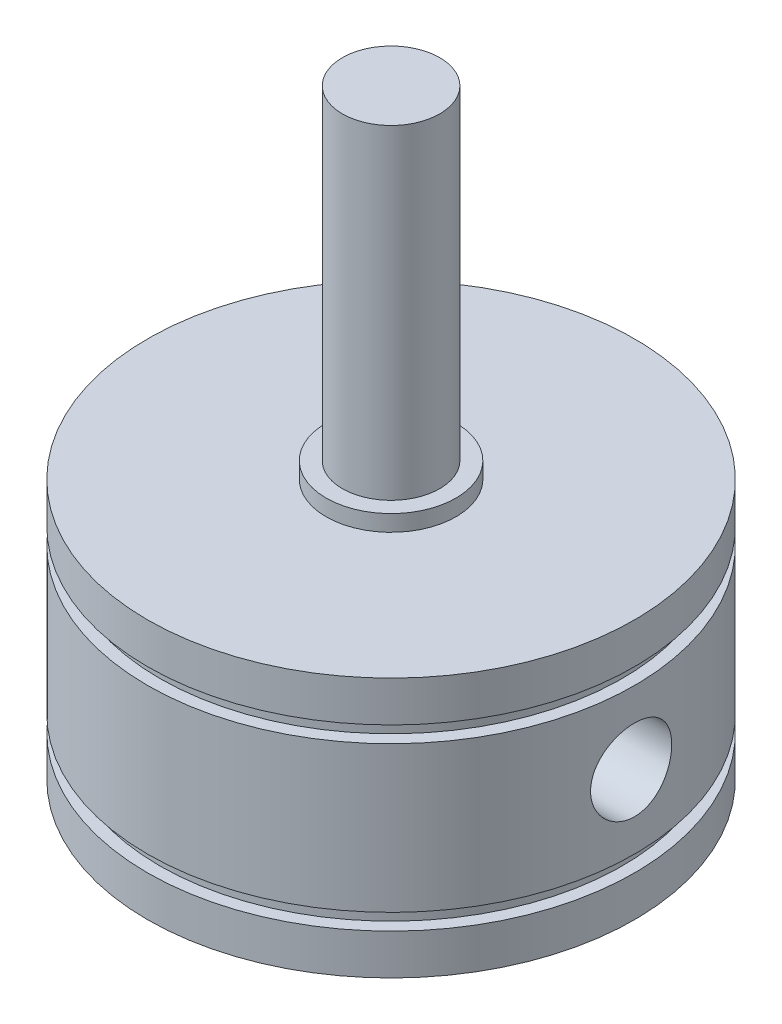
ISO-10303-21;
HEADER;
FILE_DESCRIPTION(('STEP AP214'),'2;1');
FILE_NAME('part.step','',(''),(''),'','','');
FILE_SCHEMA(('AUTOMOTIVE_DESIGN { 1 0 10303 214 1 1 1 1 }'));
ENDSEC;
DATA;
#1=APPLICATION_CONTEXT('core data for automotive mechanical design processes');
#2=APPLICATION_PROTOCOL_DEFINITION('international standard','automotive_design',2000,#1);
#3=PRODUCT_CONTEXT('',#1,'mechanical');
#4=PRODUCT('Part','Part','',(#3));
#5=PRODUCT_RELATED_PRODUCT_CATEGORY('part','',(#4));
#6=PRODUCT_DEFINITION_FORMATION('','',#4);
#7=PRODUCT_DEFINITION_CONTEXT('part definition',#1,'design');
#8=PRODUCT_DEFINITION('design','',#6,#7);
#9=PRODUCT_DEFINITION_SHAPE('','',#8);
#10=(LENGTH_UNIT() NAMED_UNIT(*) SI_UNIT(.MILLI.,.METRE.));
#11=(NAMED_UNIT(*) PLANE_ANGLE_UNIT() SI_UNIT($,.RADIAN.));
#12=(NAMED_UNIT(*) SI_UNIT($,.STERADIAN.) SOLID_ANGLE_UNIT());
#13=UNCERTAINTY_MEASURE_WITH_UNIT(LENGTH_MEASURE(1.E-05),#10,'distance_accuracy_value','');
#14=(GEOMETRIC_REPRESENTATION_CONTEXT(3) GLOBAL_UNCERTAINTY_ASSIGNED_CONTEXT((#13)) GLOBAL_UNIT_ASSIGNED_CONTEXT((#10,
#11,#12)) REPRESENTATION_CONTEXT('',''));
#15=CARTESIAN_POINT('',(0.,0.,0.));
#16=DIRECTION('',(0.,0.,1.));
#17=DIRECTION('',(1.,0.,0.));
#18=AXIS2_PLACEMENT_3D('',#15,#16,#17);
#19=CARTESIAN_POINT('',(3.,0.,0.));
#20=DIRECTION('',(0.,1.,0.));
#21=DIRECTION('',(0.,0.,1.));
#22=AXIS2_PLACEMENT_3D('',#19,#20,#21);
#23=PLANE('',#22);
#24=CARTESIAN_POINT('',(0.,0.,0.));
#25=DIRECTION('',(0.,1.,0.));
#26=DIRECTION('',(0.,0.,1.));
#27=AXIS2_PLACEMENT_3D('',#24,#25,#26);
#28=CIRCLE('',#27,3.);
#29=CARTESIAN_POINT('',(0.,0.,3.));
#30=VERTEX_POINT('',#29);
#31=EDGE_CURVE('E194',#30,#30,#28,.T.);
#32=ORIENTED_EDGE('',*,*,#31,.F.);
#33=EDGE_LOOP('',(#32));
#34=FACE_BOUND('',#33,.T.);
#35=ADVANCED_FACE('F109',(#34),#23,.F.);
#36=CARTESIAN_POINT('',(0.,41.,0.));
#37=DIRECTION('',(0.,-1.,0.));
#38=DIRECTION('',(0.,0.,-1.));
#39=AXIS2_PLACEMENT_3D('',#36,#37,#38);
#40=PLANE('',#39);
#41=CARTESIAN_POINT('',(0.,41.,0.));
#42=DIRECTION('',(0.,1.,0.));
#43=DIRECTION('',(0.,0.,1.));
#44=AXIS2_PLACEMENT_3D('',#41,#42,#43);
#45=CIRCLE('',#44,3.);
#46=CARTESIAN_POINT('',(0.,41.,3.));
#47=VERTEX_POINT('',#46);
#48=EDGE_CURVE('E119',#47,#47,#45,.T.);
#49=ORIENTED_EDGE('',*,*,#48,.T.);
#50=EDGE_LOOP('',(#49));
#51=FACE_BOUND('',#50,.T.);
#52=ADVANCED_FACE('F185',(#51),#40,.F.);
#53=CARTESIAN_POINT('',(0.,52.8834340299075,0.));
#54=DIRECTION('',(0.,1.,0.));
#55=DIRECTION('',(0.,0.,1.));
#56=AXIS2_PLACEMENT_3D('',#53,#54,#55);
#57=CYLINDRICAL_SURFACE('',#56,3.);
#58=ORIENTED_EDGE('',*,*,#48,.F.);
#59=EDGE_LOOP('',(#58));
#60=FACE_BOUND('',#59,.T.);
#61=CARTESIAN_POINT('',(0.,21.,0.));
#62=DIRECTION('',(0.,1.,0.));
#63=DIRECTION('',(0.,0.,1.));
#64=AXIS2_PLACEMENT_3D('',#61,#62,#63);
#65=CIRCLE('',#64,3.);
#66=CARTESIAN_POINT('',(0.,21.,3.));
#67=VERTEX_POINT('',#66);
#68=EDGE_CURVE('E124',#67,#67,#65,.T.);
#69=ORIENTED_EDGE('',*,*,#68,.T.);
#70=EDGE_LOOP('',(#69));
#71=FACE_BOUND('',#70,.T.);
#72=ADVANCED_FACE('F190',(#60,#71),#57,.T.);
#73=CARTESIAN_POINT('',(3.,21.,0.));
#74=DIRECTION('',(0.,-1.,0.));
#75=DIRECTION('',(0.,0.,-1.));
#76=AXIS2_PLACEMENT_3D('',#73,#74,#75);
#77=PLANE('',#76);
#78=ORIENTED_EDGE('',*,*,#68,.F.);
#79=EDGE_LOOP('',(#78));
#80=FACE_BOUND('',#79,.T.);
#81=CARTESIAN_POINT('',(0.,21.,0.));
#82=DIRECTION('',(0.,1.,0.));
#83=DIRECTION('',(0.,0.,1.));
#84=AXIS2_PLACEMENT_3D('',#81,#82,#83);
#85=CIRCLE('',#84,4.);
#86=CARTESIAN_POINT('',(0.,21.,4.));
#87=VERTEX_POINT('',#86);
#88=EDGE_CURVE('E246',#87,#87,#85,.T.);
#89=ORIENTED_EDGE('',*,*,#88,.T.);
#90=EDGE_LOOP('',(#89));
#91=FACE_BOUND('',#90,.T.);
#92=ADVANCED_FACE('F252',(#80,#91),#77,.F.);
#93=CARTESIAN_POINT('',(0.,52.8834340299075,0.));
#94=DIRECTION('',(0.,1.,0.));
#95=DIRECTION('',(0.,0.,1.));
#96=AXIS2_PLACEMENT_3D('',#93,#94,#95);
#97=CYLINDRICAL_SURFACE('',#96,4.);
#98=ORIENTED_EDGE('',*,*,#88,.F.);
#99=EDGE_LOOP('',(#98));
#100=FACE_BOUND('',#99,.T.);
#101=CARTESIAN_POINT('',(0.,20.,0.));
#102=DIRECTION('',(0.,1.,0.));
#103=DIRECTION('',(0.,0.,1.));
#104=AXIS2_PLACEMENT_3D('',#101,#102,#103);
#105=CIRCLE('',#104,4.);
#106=CARTESIAN_POINT('',(0.,20.,4.));
#107=VERTEX_POINT('',#106);
#108=EDGE_CURVE('E243',#107,#107,#105,.T.);
#109=ORIENTED_EDGE('',*,*,#108,.T.);
#110=EDGE_LOOP('',(#109));
#111=FACE_BOUND('',#110,.T.);
#112=ADVANCED_FACE('F255',(#100,#111),#97,.T.);
#113=CARTESIAN_POINT('',(4.,20.,0.));
#114=DIRECTION('',(0.,-1.,0.));
#115=DIRECTION('',(0.,0.,-1.));
#116=AXIS2_PLACEMENT_3D('',#113,#114,#115);
#117=PLANE('',#116);
#118=ORIENTED_EDGE('',*,*,#108,.F.);
#119=EDGE_LOOP('',(#118));
#120=FACE_BOUND('',#119,.T.);
#121=CARTESIAN_POINT('',(0.,20.,0.));
#122=DIRECTION('',(0.,1.,0.));
#123=DIRECTION('',(0.,0.,1.));
#124=AXIS2_PLACEMENT_3D('',#121,#122,#123);
#125=CIRCLE('',#124,15.);
#126=CARTESIAN_POINT('',(0.,20.,15.));
#127=VERTEX_POINT('',#126);
#128=EDGE_CURVE('E240',#127,#127,#125,.T.);
#129=ORIENTED_EDGE('',*,*,#128,.T.);
#130=EDGE_LOOP('',(#129));
#131=FACE_BOUND('',#130,.T.);
#132=ADVANCED_FACE('F261',(#120,#131),#117,.F.);
#133=CARTESIAN_POINT('',(0.,52.8834340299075,0.));
#134=DIRECTION('',(0.,1.,0.));
#135=DIRECTION('',(0.,0.,1.));
#136=AXIS2_PLACEMENT_3D('',#133,#134,#135);
#137=CYLINDRICAL_SURFACE('',#136,15.);
#138=ORIENTED_EDGE('',*,*,#128,.F.);
#139=EDGE_LOOP('',(#138));
#140=FACE_BOUND('',#139,.T.);
#141=CARTESIAN_POINT('',(0.,17.5,0.));
#142=DIRECTION('',(0.,1.,0.));
#143=DIRECTION('',(0.,0.,1.));
#144=AXIS2_PLACEMENT_3D('',#141,#142,#143);
#145=CIRCLE('',#144,15.);
#146=CARTESIAN_POINT('',(0.,17.5,15.));
#147=VERTEX_POINT('',#146);
#148=EDGE_CURVE('E237',#147,#147,#145,.T.);
#149=ORIENTED_EDGE('',*,*,#148,.T.);
#150=EDGE_LOOP('',(#149));
#151=FACE_BOUND('',#150,.T.);
#152=ADVANCED_FACE('F267',(#140,#151),#137,.T.);
#153=CARTESIAN_POINT('',(15.,17.5,0.));
#154=DIRECTION('',(0.,1.,0.));
#155=DIRECTION('',(0.,0.,1.));
#156=AXIS2_PLACEMENT_3D('',#153,#154,#155);
#157=PLANE('',#156);
#158=ORIENTED_EDGE('',*,*,#148,.F.);
#159=EDGE_LOOP('',(#158));
#160=FACE_BOUND('',#159,.T.);
#161=CARTESIAN_POINT('',(0.,17.5,0.));
#162=DIRECTION('',(0.,1.,0.));
#163=DIRECTION('',(0.,0.,1.));
#164=AXIS2_PLACEMENT_3D('',#161,#162,#163);
#165=CIRCLE('',#164,14.25);
#166=CARTESIAN_POINT('',(0.,17.5,14.25));
#167=VERTEX_POINT('',#166);
#168=EDGE_CURVE('E234',#167,#167,#165,.T.);
#169=ORIENTED_EDGE('',*,*,#168,.T.);
#170=EDGE_LOOP('',(#169));
#171=FACE_BOUND('',#170,.T.);
#172=ADVANCED_FACE('F273',(#160,#171),#157,.F.);
#173=CARTESIAN_POINT('',(0.,52.8834340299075,0.));
#174=DIRECTION('',(0.,1.,0.));
#175=DIRECTION('',(0.,0.,1.));
#176=AXIS2_PLACEMENT_3D('',#173,#174,#175);
#177=CYLINDRICAL_SURFACE('',#176,14.25);
#178=ORIENTED_EDGE('',*,*,#168,.F.);
#179=EDGE_LOOP('',(#178));
#180=FACE_BOUND('',#179,.T.);
#181=CARTESIAN_POINT('',(0.,16.5,0.));
#182=DIRECTION('',(0.,1.,0.));
#183=DIRECTION('',(0.,0.,1.));
#184=AXIS2_PLACEMENT_3D('',#181,#182,#183);
#185=CIRCLE('',#184,14.25);
#186=CARTESIAN_POINT('',(0.,16.5,14.25));
#187=VERTEX_POINT('',#186);
#188=EDGE_CURVE('E231',#187,#187,#185,.T.);
#189=ORIENTED_EDGE('',*,*,#188,.T.);
#190=EDGE_LOOP('',(#189));
#191=FACE_BOUND('',#190,.T.);
#192=ADVANCED_FACE('F279',(#180,#191),#177,.T.);
#193=CARTESIAN_POINT('',(14.25,16.5,0.));
#194=DIRECTION('',(0.,-1.,0.));
#195=DIRECTION('',(0.,0.,-1.));
#196=AXIS2_PLACEMENT_3D('',#193,#194,#195);
#197=PLANE('',#196);
#198=ORIENTED_EDGE('',*,*,#188,.F.);
#199=EDGE_LOOP('',(#198));
#200=FACE_BOUND('',#199,.T.);
#201=CARTESIAN_POINT('',(0.,16.5,0.));
#202=DIRECTION('',(0.,1.,0.));
#203=DIRECTION('',(0.,0.,1.));
#204=AXIS2_PLACEMENT_3D('',#201,#202,#203);
#205=CIRCLE('',#204,15.);
#206=CARTESIAN_POINT('',(0.,16.5,15.));
#207=VERTEX_POINT('',#206);
#208=EDGE_CURVE('E228',#207,#207,#205,.T.);
#209=ORIENTED_EDGE('',*,*,#208,.T.);
#210=EDGE_LOOP('',(#209));
#211=FACE_BOUND('',#210,.T.);
#212=ADVANCED_FACE('F180',(#200,#211),#197,.F.);
#213=CARTESIAN_POINT('',(0.,52.8834340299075,0.));
#214=DIRECTION('',(0.,1.,0.));
#215=DIRECTION('',(0.,0.,1.));
#216=AXIS2_PLACEMENT_3D('',#213,#214,#215);
#217=CYLINDRICAL_SURFACE('',#216,15.);
#218=CARTESIAN_POINT('',(-14.644440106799,8.78065504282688,3.24659420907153));
#219=CARTESIAN_POINT('',(-14.6934693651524,8.78065399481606,3.02543653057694));
#220=CARTESIAN_POINT('',(-14.7374902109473,8.78089183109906,2.80315828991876));
#221=CARTESIAN_POINT('',(-14.8154311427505,8.78195007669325,2.35676801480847));
#222=CARTESIAN_POINT('',(-14.8493478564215,8.78277068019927,2.13265539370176));
#223=CARTESIAN_POINT('',(-14.9070048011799,8.7853042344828,1.68303281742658));
#224=CARTESIAN_POINT('',(-14.9307407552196,8.78701755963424,1.45752231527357));
#225=CARTESIAN_POINT('',(-14.9681436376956,8.7918090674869,1.00351744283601));
#226=CARTESIAN_POINT('',(-14.9817125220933,8.79490009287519,0.775015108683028));
#227=CARTESIAN_POINT('',(-14.9983780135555,8.80299690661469,0.317766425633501));
#228=CARTESIAN_POINT('',(-15.0014792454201,8.80800184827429,0.0890202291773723));
#229=CARTESIAN_POINT('',(-14.9972235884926,8.82047977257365,-0.367997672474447));
#230=CARTESIAN_POINT('',(-14.9898816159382,8.82794922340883,-0.596269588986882));
#231=CARTESIAN_POINT('',(-14.974202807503,8.83915495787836,-0.881200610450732));
#232=CARTESIAN_POINT('',(-14.9707390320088,8.84149138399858,-0.938208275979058));
#233=CARTESIAN_POINT('',(-14.9631611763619,8.84635862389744,-1.05217317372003));
#234=CARTESIAN_POINT('',(-14.959047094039,8.84888943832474,-1.10913040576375));
#235=CARTESIAN_POINT('',(-14.9501643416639,8.854155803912,-1.22305125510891));
#236=CARTESIAN_POINT('',(-14.945394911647,8.85689159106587,-1.28001480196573));
#237=CARTESIAN_POINT('',(-14.9352064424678,8.86257205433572,-1.39387052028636));
#238=CARTESIAN_POINT('',(-14.9297874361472,8.86551671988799,-1.4507626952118));
#239=CARTESIAN_POINT('',(-14.9182805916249,8.87163248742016,-1.56467011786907));
#240=CARTESIAN_POINT('',(-14.9121904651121,8.87480435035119,-1.62168509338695));
#241=CARTESIAN_POINT('',(-14.89935722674,8.88137190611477,-1.73563887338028));
#242=CARTESIAN_POINT('',(-14.8926140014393,8.88476763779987,-1.79257766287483));
#243=CARTESIAN_POINT('',(-14.8820662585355,8.8900066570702,-1.87747175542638));
#244=CARTESIAN_POINT('',(-14.8785081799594,8.89176269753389,-1.90546331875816));
#245=CARTESIAN_POINT('',(-14.8712345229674,8.89532996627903,-1.96142291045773));
#246=CARTESIAN_POINT('',(-14.8675189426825,8.89714119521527,-1.98939093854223));
#247=CARTESIAN_POINT('',(-14.8618281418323,8.89990371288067,-2.03132055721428));
#248=CARTESIAN_POINT('',(-14.8599118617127,8.90083205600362,-2.04529176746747));
#249=CARTESIAN_POINT('',(-14.856039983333,8.90269720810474,-2.0732281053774));
#250=CARTESIAN_POINT('',(-14.8540843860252,8.90363401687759,-2.08719323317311));
#251=CARTESIAN_POINT('',(-14.8481629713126,8.90680660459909,-2.12904922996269));
#252=CARTESIAN_POINT('',(-14.844141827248,8.90940475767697,-2.15690589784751));
#253=CARTESIAN_POINT('',(-14.8359798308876,8.91544907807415,-2.21234785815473));
#254=CARTESIAN_POINT('',(-14.8318397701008,8.91889044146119,-2.23993379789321));
#255=CARTESIAN_POINT('',(-14.8234241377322,8.92664555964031,-2.29496670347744));
#256=CARTESIAN_POINT('',(-14.8191485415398,8.93095947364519,-2.32241364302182));
#257=CARTESIAN_POINT('',(-14.8061267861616,8.94519080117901,-2.40451218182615));
#258=CARTESIAN_POINT('',(-14.7971865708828,8.95639712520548,-2.45891532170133));
#259=CARTESIAN_POINT('',(-14.778881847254,8.98213682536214,-2.56663708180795));
#260=CARTESIAN_POINT('',(-14.7695190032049,8.9966579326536,-2.61995893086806));
#261=CARTESIAN_POINT('',(-14.7504042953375,9.02897259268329,-2.72551845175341));
#262=CARTESIAN_POINT('',(-14.7406524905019,9.04676565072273,-2.77775628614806));
#263=CARTESIAN_POINT('',(-14.716432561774,9.09415258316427,-2.90385258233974));
#264=CARTESIAN_POINT('',(-14.7017896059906,9.12548162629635,-2.97703286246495));
#265=CARTESIAN_POINT('',(-14.6720263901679,9.19457453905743,-3.12042020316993));
#266=CARTESIAN_POINT('',(-14.6569049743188,9.23235514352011,-3.19061892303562));
#267=CARTESIAN_POINT('',(-14.6263764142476,9.31405495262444,-3.32777284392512));
#268=CARTESIAN_POINT('',(-14.6109682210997,9.35800383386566,-3.39471012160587));
#269=CARTESIAN_POINT('',(-14.5802107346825,9.45147652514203,-3.52447127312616));
#270=CARTESIAN_POINT('',(-14.5648613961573,9.50099434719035,-3.58729945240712));
#271=CARTESIAN_POINT('',(-14.5345237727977,9.60510014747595,-3.70830078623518));
#272=CARTESIAN_POINT('',(-14.5195344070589,9.659669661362,-3.76648955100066));
#273=CARTESIAN_POINT('',(-14.4901335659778,9.77369755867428,-3.87806171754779));
#274=CARTESIAN_POINT('',(-14.4757222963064,9.83315765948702,-3.93144341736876));
#275=CARTESIAN_POINT('',(-14.4477316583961,9.95632719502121,-4.03309117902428));
#276=CARTESIAN_POINT('',(-14.4341511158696,10.0200303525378,-4.08136453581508));
#277=CARTESIAN_POINT('',(-14.4080206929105,10.1512808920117,-4.17267237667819));
#278=CARTESIAN_POINT('',(-14.3954707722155,10.218828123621,-4.21570706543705));
#279=CARTESIAN_POINT('',(-14.3714042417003,10.3586572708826,-4.29704234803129));
#280=CARTESIAN_POINT('',(-14.3599117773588,10.4310047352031,-4.33523753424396));
#281=CARTESIAN_POINT('',(-14.3384902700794,10.5788055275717,-4.40557020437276));
#282=CARTESIAN_POINT('',(-14.3285610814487,10.6542585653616,-4.43770825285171));
#283=CARTESIAN_POINT('',(-14.3104900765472,10.8077766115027,-4.49564211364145));
#284=CARTESIAN_POINT('',(-14.3023484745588,10.8858419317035,-4.5214371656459));
#285=CARTESIAN_POINT('',(-14.2879538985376,11.043961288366,-4.56672052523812));
#286=CARTESIAN_POINT('',(-14.2817012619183,11.1240156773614,-4.58620770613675));
#287=CARTESIAN_POINT('',(-14.2711877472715,11.2857454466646,-4.61881968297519));
#288=CARTESIAN_POINT('',(-14.2669318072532,11.3674243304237,-4.63192870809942));
#289=CARTESIAN_POINT('',(-14.260538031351,11.5316401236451,-4.65157626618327));
#290=CARTESIAN_POINT('',(-14.2583997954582,11.6141768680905,-4.65811603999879));
#291=CARTESIAN_POINT('',(-14.2563598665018,11.7795555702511,-4.66435581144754));
#292=CARTESIAN_POINT('',(-14.2564585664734,11.8623975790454,-4.66405460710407));
#293=CARTESIAN_POINT('',(-14.2588884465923,12.0277474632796,-4.6566205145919));
#294=CARTESIAN_POINT('',(-14.2612199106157,12.1102552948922,-4.64948675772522));
#295=CARTESIAN_POINT('',(-14.267961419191,12.273318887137,-4.62875729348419));
#296=CARTESIAN_POINT('',(-14.2723452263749,12.353886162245,-4.61524313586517));
#297=CARTESIAN_POINT('',(-14.2830864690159,12.5135640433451,-4.58189341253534));
#298=CARTESIAN_POINT('',(-14.2894438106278,12.5926747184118,-4.56205814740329));
#299=CARTESIAN_POINT('',(-14.3040219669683,12.7488437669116,-4.51614182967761));
#300=CARTESIAN_POINT('',(-14.3122417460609,12.8259032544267,-4.49006424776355));
#301=CARTESIAN_POINT('',(-14.3304479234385,12.977378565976,-4.43161320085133));
#302=CARTESIAN_POINT('',(-14.340434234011,13.0517945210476,-4.39924004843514));
#303=CARTESIAN_POINT('',(-14.3619534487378,13.1975467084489,-4.32847106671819));
#304=CARTESIAN_POINT('',(-14.3734876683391,13.2688802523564,-4.29007011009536));
#305=CARTESIAN_POINT('',(-14.3978480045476,13.407962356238,-4.207590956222));
#306=CARTESIAN_POINT('',(-14.410674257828,13.4757105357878,-4.16351215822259));
#307=CARTESIAN_POINT('',(-14.4374033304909,13.6072968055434,-4.06986014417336));
#308=CARTESIAN_POINT('',(-14.4513083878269,13.671126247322,-4.02027540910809));
#309=CARTESIAN_POINT('',(-14.4799367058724,13.7941882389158,-3.91591116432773));
#310=CARTESIAN_POINT('',(-14.4946599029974,13.8534211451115,-3.86113205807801));
#311=CARTESIAN_POINT('',(-14.5246748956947,13.9667440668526,-3.74664079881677));
#312=CARTESIAN_POINT('',(-14.5399666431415,14.0208345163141,-3.6869290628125));
#313=CARTESIAN_POINT('',(-14.5708236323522,14.1235222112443,-3.56302883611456));
#314=CARTESIAN_POINT('',(-14.5863888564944,14.1721198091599,-3.49884063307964));
#315=CARTESIAN_POINT('',(-14.6174360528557,14.2632230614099,-3.36677010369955));
#316=CARTESIAN_POINT('',(-14.6329180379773,14.3057590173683,-3.29890867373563));
#317=CARTESIAN_POINT('',(-14.6636298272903,14.3846869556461,-3.15959604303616));
#318=CARTESIAN_POINT('',(-14.6788595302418,14.4210765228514,-3.08814344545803));
#319=CARTESIAN_POINT('',(-14.7035223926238,14.4755499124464,-2.9679544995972));
#320=CARTESIAN_POINT('',(-14.7131024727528,14.4955589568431,-2.92011135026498));
#321=CARTESIAN_POINT('',(-14.7319873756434,14.5327322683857,-2.82329215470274));
#322=CARTESIAN_POINT('',(-14.741292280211,14.5498973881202,-2.77431645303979));
#323=CARTESIAN_POINT('',(-14.7595576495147,14.5813065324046,-2.67544073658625));
#324=CARTESIAN_POINT('',(-14.7685185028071,14.5955539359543,-2.6255418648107));
#325=CARTESIAN_POINT('',(-14.7861018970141,14.6211702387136,-2.5246438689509));
#326=CARTESIAN_POINT('',(-14.7947222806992,14.6325226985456,-2.47364017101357));
#327=CARTESIAN_POINT('',(-14.8073220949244,14.6472783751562,-2.39664140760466));
#328=CARTESIAN_POINT('',(-14.8114679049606,14.6518189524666,-2.37088642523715));
#329=CARTESIAN_POINT('',(-14.8196432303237,14.6601354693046,-2.31923648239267));
#330=CARTESIAN_POINT('',(-14.8236727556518,14.6639114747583,-2.29334153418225));
#331=CARTESIAN_POINT('',(-14.8316156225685,14.670698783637,-2.24139894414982));
#332=CARTESIAN_POINT('',(-14.8355288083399,14.6737090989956,-2.2153511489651));
#333=CARTESIAN_POINT('',(-14.8413038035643,14.6776393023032,-2.17620665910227));
#334=CARTESIAN_POINT('',(-14.8432131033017,14.6788518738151,-2.16314566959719));
#335=CARTESIAN_POINT('',(-14.8469995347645,14.6810858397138,-2.13700240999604));
#336=CARTESIAN_POINT('',(-14.8488766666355,14.682107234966,-2.12392013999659));
#337=CARTESIAN_POINT('',(-14.8542218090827,14.684738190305,-2.08631426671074));
#338=CARTESIAN_POINT('',(-14.8576488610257,14.6860833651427,-2.06176720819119));
#339=CARTESIAN_POINT('',(-14.8643808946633,14.6888114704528,-2.01265878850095));
#340=CARTESIAN_POINT('',(-14.8676858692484,14.6901944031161,-1.98809742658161));
#341=CARTESIAN_POINT('',(-14.8741747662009,14.6928988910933,-1.93895311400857));
#342=CARTESIAN_POINT('',(-14.877358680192,14.6942204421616,-1.91437016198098));
#343=CARTESIAN_POINT('',(-14.8836047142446,14.6968290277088,-1.86518772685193));
#344=CARTESIAN_POINT('',(-14.8866668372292,14.698116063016,-1.84058824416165));
#345=CARTESIAN_POINT('',(-14.8956707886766,14.7019164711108,-1.76676259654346));
#346=CARTESIAN_POINT('',(-14.9014299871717,14.7043690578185,-1.7175108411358));
#347=CARTESIAN_POINT('',(-14.9124601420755,14.709121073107,-1.61894766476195));
#348=CARTESIAN_POINT('',(-14.9177311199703,14.7114205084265,-1.56963624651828));
#349=CARTESIAN_POINT('',(-14.9277844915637,14.7158691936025,-1.47095545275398));
#350=CARTESIAN_POINT('',(-14.93256687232,14.7180184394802,-1.42158607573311));
#351=CARTESIAN_POINT('',(-14.9416422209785,14.722171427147,-1.32279564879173));
#352=CARTESIAN_POINT('',(-14.9459351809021,14.724175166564,-1.2733745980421));
#353=CARTESIAN_POINT('',(-14.9580763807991,14.729973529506,-1.12507285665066));
#354=CARTESIAN_POINT('',(-14.9651900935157,14.7335566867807,-1.02612263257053));
#355=CARTESIAN_POINT('',(-14.9774529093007,14.7401967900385,-0.828096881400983));
#356=CARTESIAN_POINT('',(-14.9826022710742,14.7432538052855,-0.729021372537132));
#357=CARTESIAN_POINT('',(-14.9909345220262,14.7488831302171,-0.530777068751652));
#358=CARTESIAN_POINT('',(-14.9941174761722,14.7514554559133,-0.43160827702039));
#359=CARTESIAN_POINT('',(-14.9985148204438,14.7561583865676,-0.233228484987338));
#360=CARTESIAN_POINT('',(-14.9997294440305,14.7582890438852,-0.134017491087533));
#361=CARTESIAN_POINT('',(-15.0001898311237,14.7621539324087,0.0644223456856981));
#362=CARTESIAN_POINT('',(-14.9994354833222,14.763888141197,0.163651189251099));
#363=CARTESIAN_POINT('',(-14.9959576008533,14.7670058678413,0.362080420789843));
#364=CARTESIAN_POINT('',(-14.9932340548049,14.7683893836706,0.461280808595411));
#365=CARTESIAN_POINT('',(-14.9858193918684,14.7708515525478,0.659591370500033));
#366=CARTESIAN_POINT('',(-14.9811286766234,14.7719302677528,0.758701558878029));
#367=CARTESIAN_POINT('',(-14.969781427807,14.7738291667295,0.956811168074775));
#368=CARTESIAN_POINT('',(-14.9631249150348,14.7746493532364,1.05581059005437));
#369=CARTESIAN_POINT('',(-14.9478486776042,14.7760751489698,1.25366093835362));
#370=CARTESIAN_POINT('',(-14.9392288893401,14.7766807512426,1.35251185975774));
#371=CARTESIAN_POINT('',(-14.9095466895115,14.7782866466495,1.6578581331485));
#372=CARTESIAN_POINT('',(-14.8851746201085,14.7789959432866,1.86404370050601));
#373=CARTESIAN_POINT('',(-14.8278932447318,14.7799845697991,2.27523136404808));
#374=CARTESIAN_POINT('',(-14.7949834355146,14.7802638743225,2.4802333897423));
#375=CARTESIAN_POINT('',(-14.7206587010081,14.7806048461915,2.88883257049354));
#376=CARTESIAN_POINT('',(-14.6792381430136,14.7806663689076,3.09242870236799));
#377=CARTESIAN_POINT('',(-14.5879768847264,14.7806406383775,3.49772490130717));
#378=CARTESIAN_POINT('',(-14.538136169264,14.7805533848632,3.69942496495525));
#379=CARTESIAN_POINT('',(-14.4303489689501,14.7801452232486,4.09973329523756));
#380=CARTESIAN_POINT('',(-14.3724376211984,14.779825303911,4.29835102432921));
#381=CARTESIAN_POINT('',(-14.2484502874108,14.7787202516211,4.69302124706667));
#382=CARTESIAN_POINT('',(-14.1823742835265,14.7779351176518,4.88907373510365));
#383=CARTESIAN_POINT('',(-14.0422884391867,14.7755506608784,5.27795209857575));
#384=CARTESIAN_POINT('',(-13.9682918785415,14.7739526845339,5.47078276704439));
#385=CARTESIAN_POINT('',(-13.8124036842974,14.7695128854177,5.85321626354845));
#386=CARTESIAN_POINT('',(-13.7305120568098,14.7666710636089,6.04281909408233));
#387=CARTESIAN_POINT('',(-13.5807645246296,14.7602158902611,6.3707588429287));
#388=CARTESIAN_POINT('',(-13.5146240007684,14.7569816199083,6.50988956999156));
#389=CARTESIAN_POINT('',(-13.3781127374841,14.7493696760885,6.78600117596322));
#390=CARTESIAN_POINT('',(-13.3077427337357,14.7449922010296,6.92298242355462));
#391=CARTESIAN_POINT('',(-13.1625047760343,14.7348873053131,7.1953034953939));
#392=CARTESIAN_POINT('',(-13.0876175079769,14.7291537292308,7.33063278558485));
#393=CARTESIAN_POINT('',(-12.9336955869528,14.7161745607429,7.5989105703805));
#394=CARTESIAN_POINT('',(-12.8546593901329,14.7089284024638,7.73185815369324));
#395=CARTESIAN_POINT('',(-12.740534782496,14.6975552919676,7.91724420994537));
#396=CARTESIAN_POINT('',(-12.707120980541,14.6941204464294,7.97076257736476));
#397=CARTESIAN_POINT('',(-12.6565076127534,14.6887549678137,8.0507024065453));
#398=CARTESIAN_POINT('',(-12.639557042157,14.6869312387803,8.07728863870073));
#399=CARTESIAN_POINT('',(-12.6140065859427,14.6841405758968,8.11708607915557));
#400=CARTESIAN_POINT('',(-12.6054685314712,14.6832011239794,8.13033896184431));
#401=CARTESIAN_POINT('',(-12.5883510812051,14.6813051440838,8.15681712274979));
#402=CARTESIAN_POINT('',(-12.5797716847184,14.6803486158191,8.17004240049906));
#403=CARTESIAN_POINT('',(-12.5625755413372,14.6784130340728,8.19645924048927));
#404=CARTESIAN_POINT('',(-12.5539588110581,14.6774339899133,8.20965081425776));
#405=CARTESIAN_POINT('',(-12.5410026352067,14.6759642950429,8.22941765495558));
#406=CARTESIAN_POINT('',(-12.5366787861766,14.6754742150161,8.23600309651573));
#407=CARTESIAN_POINT('',(-12.528023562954,14.6744178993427,8.24916284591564));
#408=CARTESIAN_POINT('',(-12.5236921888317,14.6738516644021,8.25573715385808));
#409=CARTESIAN_POINT('',(-12.5020208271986,14.6708448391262,8.28857440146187));
#410=CARTESIAN_POINT('',(-12.484624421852,14.6678757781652,8.31475416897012));
#411=CARTESIAN_POINT('',(-12.4498826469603,14.6608385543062,8.36668333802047));
#412=CARTESIAN_POINT('',(-12.4325380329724,14.6567796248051,8.39243450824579));
#413=CARTESIAN_POINT('',(-12.397777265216,14.6475636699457,8.44370050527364));
#414=CARTESIAN_POINT('',(-12.3803610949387,14.6424063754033,8.46921527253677));
#415=CARTESIAN_POINT('',(-12.3454846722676,14.6310028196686,8.51997396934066));
#416=CARTESIAN_POINT('',(-12.3280244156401,14.6247564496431,8.54521787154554));
#417=CARTESIAN_POINT('',(-12.2930897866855,14.6111869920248,8.59539867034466));
#418=CARTESIAN_POINT('',(-12.275615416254,14.6038640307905,8.62033560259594));
#419=CARTESIAN_POINT('',(-12.2232131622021,14.5802984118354,8.69463810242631));
#420=CARTESIAN_POINT('',(-12.1882952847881,14.5624554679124,8.74351115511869));
#421=CARTESIAN_POINT('',(-12.1109062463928,14.5181369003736,8.85049293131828));
#422=CARTESIAN_POINT('',(-12.0684951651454,14.4906228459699,8.90821822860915));
#423=CARTESIAN_POINT('',(-11.9844528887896,14.4295941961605,9.02096719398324));
#424=CARTESIAN_POINT('',(-11.9428217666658,14.3960790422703,9.0759906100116));
#425=CARTESIAN_POINT('',(-11.8190847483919,14.2866030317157,9.23729364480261));
#426=CARTESIAN_POINT('',(-11.7386049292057,14.201982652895,9.33916089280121));
#427=CARTESIAN_POINT('',(-11.6237581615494,14.0603438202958,9.4811379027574));
#428=CARTESIAN_POINT('',(-11.5865030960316,14.0107596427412,9.52660313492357));
#429=CARTESIAN_POINT('',(-11.5142115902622,13.9069126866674,9.61385090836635));
#430=CARTESIAN_POINT('',(-11.4791750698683,13.8526500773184,9.65563358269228));
#431=CARTESIAN_POINT('',(-11.4117484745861,13.7399979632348,9.73523074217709));
#432=CARTESIAN_POINT('',(-11.3793524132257,13.6816183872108,9.77305426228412));
#433=CARTESIAN_POINT('',(-11.3173316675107,13.5611051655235,9.84480830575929));
#434=CARTESIAN_POINT('',(-11.287707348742,13.4989710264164,9.87873831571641));
#435=CARTESIAN_POINT('',(-11.2303721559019,13.3688056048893,9.94387751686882));
#436=CARTESIAN_POINT('',(-11.2027854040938,13.3006378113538,9.97492335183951));
#437=CARTESIAN_POINT('',(-11.1512038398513,13.1611401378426,10.0325543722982));
#438=CARTESIAN_POINT('',(-11.1272085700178,13.0898106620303,10.0591401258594));
#439=CARTESIAN_POINT('',(-11.0831378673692,12.9443434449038,10.1076769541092));
#440=CARTESIAN_POINT('',(-11.0630656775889,12.8702034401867,10.1296241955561));
#441=CARTESIAN_POINT('',(-11.0270304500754,12.7197140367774,10.1688401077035));
#442=CARTESIAN_POINT('',(-11.0110680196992,12.6433643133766,10.1861080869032));
#443=CARTESIAN_POINT('',(-10.9829972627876,12.4872961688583,10.2163695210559));
#444=CARTESIAN_POINT('',(-10.9709831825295,12.4075405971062,10.2292586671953));
#445=CARTESIAN_POINT('',(-10.9514300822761,12.2468582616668,10.2501894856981));
#446=CARTESIAN_POINT('',(-10.9438908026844,12.1659315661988,10.2582314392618));
#447=CARTESIAN_POINT('',(-10.9334197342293,12.0034301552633,10.2693910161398));
#448=CARTESIAN_POINT('',(-10.9304883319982,11.921855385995,10.2725082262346));
#449=CARTESIAN_POINT('',(-10.9294169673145,11.758640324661,10.2736481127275));
#450=CARTESIAN_POINT('',(-10.9312768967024,11.6770000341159,10.2716709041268));
#451=CARTESIAN_POINT('',(-10.9396821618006,11.5133157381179,10.2627185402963));
#452=CARTESIAN_POINT('',(-10.946280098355,11.4312775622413,10.2556872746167));
#453=CARTESIAN_POINT('',(-10.9640448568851,11.2682676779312,10.2366932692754));
#454=CARTESIAN_POINT('',(-10.9752122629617,11.1872961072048,10.2247298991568));
#455=CARTESIAN_POINT('',(-11.0019748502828,11.0269896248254,10.1959274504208));
#456=CARTESIAN_POINT('',(-11.0175684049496,10.9476541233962,10.1790901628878));
#457=CARTESIAN_POINT('',(-11.0530863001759,10.7912158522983,10.140511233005));
#458=CARTESIAN_POINT('',(-11.0730099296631,10.7141127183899,10.1187703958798));
#459=CARTESIAN_POINT('',(-11.1396166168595,10.4851667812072,10.0455634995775));
#460=CARTESIAN_POINT('',(-11.1928351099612,10.3374895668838,9.9864291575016));
#461=CARTESIAN_POINT('',(-11.2832881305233,10.1275408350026,9.88379909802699));
#462=CARTESIAN_POINT('',(-11.3152617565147,10.0593993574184,9.8472072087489));
#463=CARTESIAN_POINT('',(-11.3824688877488,9.92743611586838,9.76944448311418));
#464=CARTESIAN_POINT('',(-11.4177020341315,9.86361387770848,9.72827415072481));
#465=CARTESIAN_POINT('',(-11.4909688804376,9.7412213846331,9.64161993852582));
#466=CARTESIAN_POINT('',(-11.5289892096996,9.68262870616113,9.59615638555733));
#467=CARTESIAN_POINT('',(-11.607553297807,9.57083883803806,9.50097430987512));
#468=CARTESIAN_POINT('',(-11.6480969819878,9.51764148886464,9.45125591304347));
#469=CARTESIAN_POINT('',(-11.7310645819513,9.4172721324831,9.34807398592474));
#470=CARTESIAN_POINT('',(-11.7734792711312,9.37007422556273,9.29462821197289));
#471=CARTESIAN_POINT('',(-11.8599381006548,9.28182826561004,9.18405094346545));
#472=CARTESIAN_POINT('',(-11.9039826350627,9.24078171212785,9.12691855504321));
#473=CARTESIAN_POINT('',(-11.9771049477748,9.17898484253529,9.03056928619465));
#474=CARTESIAN_POINT('',(-12.0058370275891,9.15626168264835,8.99234261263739));
#475=CARTESIAN_POINT('',(-12.0636641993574,9.11365249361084,8.91461443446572));
#476=CARTESIAN_POINT('',(-12.0927592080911,9.09376582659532,8.87511321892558));
#477=CARTESIAN_POINT('',(-12.1511670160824,9.05691933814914,8.79497566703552));
#478=CARTESIAN_POINT('',(-12.1804796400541,9.03995738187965,8.75434018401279));
#479=CARTESIAN_POINT('',(-12.2393448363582,9.00895012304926,8.67185195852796));
#480=CARTESIAN_POINT('',(-12.2688978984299,8.99491768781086,8.62999472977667));
#481=CARTESIAN_POINT('',(-12.3280006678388,8.96992463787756,8.54535332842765));
#482=CARTESIAN_POINT('',(-12.3575503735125,8.9589645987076,8.50256898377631));
#483=CARTESIAN_POINT('',(-12.4017800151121,8.94487228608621,8.43780406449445));
#484=CARTESIAN_POINT('',(-12.4165130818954,8.94056492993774,8.41610919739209));
#485=CARTESIAN_POINT('',(-12.4459288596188,8.93274507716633,8.37254711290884));
#486=CARTESIAN_POINT('',(-12.4606115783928,8.92923245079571,8.35067992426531));
#487=CARTESIAN_POINT('',(-12.4887580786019,8.92324191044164,8.30852047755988));
#488=CARTESIAN_POINT('',(-12.5022267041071,8.92070425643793,8.28823996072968));
#489=CARTESIAN_POINT('',(-12.5223821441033,8.91743458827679,8.25772935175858));
#490=CARTESIAN_POINT('',(-12.5290931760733,8.91643411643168,8.24754345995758));
#491=CARTESIAN_POINT('',(-12.542495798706,8.91456013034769,8.22714701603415));
#492=CARTESIAN_POINT('',(-12.5491873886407,8.9136866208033,8.21693646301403));
#493=CARTESIAN_POINT('',(-12.5692283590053,8.91105470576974,8.18627479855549));
#494=CARTESIAN_POINT('',(-12.5825398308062,8.90928544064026,8.16579990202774));
#495=CARTESIAN_POINT('',(-12.6090643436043,8.90581426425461,8.12478262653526));
#496=CARTESIAN_POINT('',(-12.6222773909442,8.90411234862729,8.10424025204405));
#497=CARTESIAN_POINT('',(-12.661791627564,8.89906814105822,8.04247621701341));
#498=CARTESIAN_POINT('',(-12.6879441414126,8.8957905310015,8.0011540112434));
#499=CARTESIAN_POINT('',(-12.7398452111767,8.88942297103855,7.91825328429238));
#500=CARTESIAN_POINT('',(-12.7655938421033,8.88633298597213,7.87667481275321));
#501=CARTESIAN_POINT('',(-12.8166980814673,8.88032966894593,7.79324350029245));
#502=CARTESIAN_POINT('',(-12.8420535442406,8.87741640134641,7.75139056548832));
#503=CARTESIAN_POINT('',(-12.8923600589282,8.87176442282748,7.66742769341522));
#504=CARTESIAN_POINT('',(-12.9173110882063,8.8690257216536,7.62531774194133));
#505=CARTESIAN_POINT('',(-12.9916183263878,8.86105697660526,7.4984974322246));
#506=CARTESIAN_POINT('',(-13.0403595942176,8.85608238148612,7.41340940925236));
#507=CARTESIAN_POINT('',(-13.1361535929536,8.84677627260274,7.24231156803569));
#508=CARTESIAN_POINT('',(-13.1832071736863,8.84244443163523,7.15630224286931));
#509=CARTESIAN_POINT('',(-13.2756239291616,8.83437773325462,6.98336736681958));
#510=CARTESIAN_POINT('',(-13.3209873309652,8.83064279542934,6.89644194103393));
#511=CARTESIAN_POINT('',(-13.4129469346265,8.82349489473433,6.715934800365));
#512=CARTESIAN_POINT('',(-13.459426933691,8.82011944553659,6.62229238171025));
#513=CARTESIAN_POINT('',(-13.5504345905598,8.81393508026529,6.43402334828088));
#514=CARTESIAN_POINT('',(-13.594961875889,8.8111262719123,6.33939654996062));
#515=CARTESIAN_POINT('',(-13.6820347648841,8.80601594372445,6.14921643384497));
#516=CARTESIAN_POINT('',(-13.724580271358,8.80371444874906,6.05366307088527));
#517=CARTESIAN_POINT('',(-13.8076352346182,8.79956016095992,5.86175170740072));
#518=CARTESIAN_POINT('',(-13.8481462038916,8.79770703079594,5.76539436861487));
#519=CARTESIAN_POINT('',(-13.9271451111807,8.79438744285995,5.57185363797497));
#520=CARTESIAN_POINT('',(-13.9656331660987,8.79292096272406,5.47467029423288));
#521=CARTESIAN_POINT('',(-14.0405702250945,8.79031711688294,5.27951826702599));
#522=CARTESIAN_POINT('',(-14.0770192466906,8.78917974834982,5.18154959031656));
#523=CARTESIAN_POINT('',(-14.1664906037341,8.78665442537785,4.93315116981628));
#524=CARTESIAN_POINT('',(-14.2181488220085,8.78544921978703,4.78222577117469));
#525=CARTESIAN_POINT('',(-14.316625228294,8.78351284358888,4.4788038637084));
#526=CARTESIAN_POINT('',(-14.3634434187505,8.78278167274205,4.32630735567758));
#527=CARTESIAN_POINT('',(-14.4521629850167,8.78166511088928,4.01999886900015));
#528=CARTESIAN_POINT('',(-14.4940676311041,8.78127948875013,3.86618783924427));
#529=CARTESIAN_POINT('',(-14.5729551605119,8.78077481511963,3.55730096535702));
#530=CARTESIAN_POINT('',(-14.6099377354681,8.7806557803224,3.40222504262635));
#531=CARTESIAN_POINT('',(-14.644440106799,8.78065504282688,3.24659420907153));
#532=B_SPLINE_CURVE_WITH_KNOTS('',3,(#218,#219,#220,#221,#222,#223,#224,#225,#226,#227,#228,
#229,#230,#231,#232,#233,#234,#235,#236,#237,#238,#239,#240,#241,#242,#243,#244,#245,#246,#247,
#248,#249,#250,#251,#252,#253,#254,#255,#256,#257,#258,#259,#260,#261,#262,#263,#264,#265,#266,
#267,#268,#269,#270,#271,#272,#273,#274,#275,#276,#277,#278,#279,#280,#281,#282,#283,#284,#285,
#286,#287,#288,#289,#290,#291,#292,#293,#294,#295,#296,#297,#298,#299,#300,#301,#302,#303,#304,
#305,#306,#307,#308,#309,#310,#311,#312,#313,#314,#315,#316,#317,#318,#319,#320,#321,#322,#323,
#324,#325,#326,#327,#328,#329,#330,#331,#332,#333,#334,#335,#336,#337,#338,#339,#340,#341,#342,
#343,#344,#345,#346,#347,#348,#349,#350,#351,#352,#353,#354,#355,#356,#357,#358,#359,#360,#361,
#362,#363,#364,#365,#366,#367,#368,#369,#370,#371,#372,#373,#374,#375,#376,#377,#378,#379,#380,
#381,#382,#383,#384,#385,#386,#387,#388,#389,#390,#391,#392,#393,#394,#395,#396,#397,#398,#399,
#400,#401,#402,#403,#404,#405,#406,#407,#408,#409,#410,#411,#412,#413,#414,#415,#416,#417,#418,
#419,#420,#421,#422,#423,#424,#425,#426,#427,#428,#429,#430,#431,#432,#433,#434,#435,#436,#437,
#438,#439,#440,#441,#442,#443,#444,#445,#446,#447,#448,#449,#450,#451,#452,#453,#454,#455,#456,
#457,#458,#459,#460,#461,#462,#463,#464,#465,#466,#467,#468,#469,#470,#471,#472,#473,#474,#475,
#476,#477,#478,#479,#480,#481,#482,#483,#484,#485,#486,#487,#488,#489,#490,#491,#492,#493,#494,
#495,#496,#497,#498,#499,#500,#501,#502,#503,#504,#505,#506,#507,#508,#509,#510,#511,#512,#513,
#514,#515,#516,#517,#518,#519,#520,#521,#522,#523,#524,#525,#526,#527,#528,#529,#530,#531),
.UNSPECIFIED.,.T.,.F.,(4,2,2,2,2,2,2,2,2,2,2,2,2,2,2,2,2,2,2,2,2,2,2,2,2,2,2,2,2,2,2,2,2,2,2,2,
2,2,2,2,2,2,2,2,2,2,2,2,2,2,2,2,2,2,2,2,2,2,2,2,2,2,2,2,2,2,2,2,2,2,2,2,2,2,2,2,2,2,2,2,2,2,2,2,
2,2,2,2,2,2,2,2,2,2,2,2,2,2,2,2,2,2,2,2,2,2,2,2,2,2,2,2,2,2,2,2,2,2,2,2,2,2,2,2,2,2,2,2,2,2,2,2,
2,2,2,2,2,2,2,2,2,2,2,2,2,2,2,2,2,2,2,2,2,2,2,2,4),(0.,0.679540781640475,1.35930811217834,
2.03936074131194,2.72588978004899,3.41211545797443,4.09736196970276,4.26884177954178,
4.44032216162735,4.61200310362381,4.78367536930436,4.95595223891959,5.12825908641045,
5.21307287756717,5.29788767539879,5.34028540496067,5.38268210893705,5.46745981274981,
5.55176531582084,5.63608621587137,5.80474683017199,5.97279303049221,6.14081384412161,
6.38329850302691,6.62642197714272,6.87075803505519,7.11483383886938,7.35805032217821,
7.60135258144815,7.84430256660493,8.08724305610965,8.33479652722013,8.58232691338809,
8.82988695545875,9.07749119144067,9.32570458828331,9.57387109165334,9.82208119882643,
10.0703228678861,10.3154742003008,10.5606138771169,10.8056175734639,11.0506091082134,
11.2958101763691,11.5410372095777,11.7867873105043,12.0325183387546,12.2782286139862,
12.5239231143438,12.7683427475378,13.0128581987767,13.170985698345,13.3290657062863,
13.4869615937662,13.6457350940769,13.725161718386,13.8045814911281,13.8841032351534,
13.9238683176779,13.9636332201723,14.0380935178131,14.1125581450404,14.1870279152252,
14.2614958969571,14.4104367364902,14.5593710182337,14.7083092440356,14.8572498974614,
15.1550378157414,15.4527865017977,15.7505253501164,16.0482288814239,16.3459492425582,
16.6436713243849,16.9413326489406,17.2389908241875,17.5366586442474,18.1593283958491,
18.7820348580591,19.4051547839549,20.0282758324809,20.648764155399,21.2692538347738,
21.8887190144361,22.5081837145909,22.9703688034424,23.4324737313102,23.896717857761,
24.3611359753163,24.5506901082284,24.6454378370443,24.69281686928,24.7401966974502,
24.7875572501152,24.811236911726,24.834916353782,24.9296104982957,25.023526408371,
25.1174653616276,25.2114137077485,25.3053510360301,25.4931673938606,25.7230540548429,
25.9529621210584,26.4152758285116,26.6457842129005,26.876284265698,27.1062462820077,
27.3362385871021,27.5754405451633,27.8146120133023,28.0539803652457,28.2933840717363,
28.5381454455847,28.7828926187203,29.027660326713,29.2724225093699,29.5199448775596,
29.7674988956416,30.0149620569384,30.2623846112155,30.762722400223,31.0135879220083,
31.2644258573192,31.5141306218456,31.7638280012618,32.0124079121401,32.2610483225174,
32.4198001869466,32.5785162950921,32.7371160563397,32.896398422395,33.0557106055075,
33.1354283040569,33.2151329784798,33.2885542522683,33.3252700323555,33.3619871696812,
33.4354438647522,33.5088957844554,33.6559302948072,33.8029371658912,33.949997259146,
34.0970655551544,34.3915996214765,34.6859832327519,34.9803271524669,35.2940955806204,
35.6079236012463,35.921766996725,36.2353735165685,36.548961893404,36.8625475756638,
37.3410377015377,37.8195275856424,38.2976971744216,38.775896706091),.UNSPECIFIED.);
#533=CARTESIAN_POINT('',(-14.644440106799,8.78065504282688,3.24659420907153));
#534=VERTEX_POINT('',#533);
#535=EDGE_CURVE('E197',#534,#534,#532,.T.);
#536=ORIENTED_EDGE('',*,*,#535,.T.);
#537=EDGE_LOOP('',(#536));
#538=FACE_BOUND('',#537,.T.);
#539=CARTESIAN_POINT('',(15.,14.5,0.));
#540=CARTESIAN_POINT('',(14.9999976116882,14.4999944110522,-0.139390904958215));
#541=CARTESIAN_POINT('',(14.9980367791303,14.4883027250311,-0.278857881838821));
#542=CARTESIAN_POINT('',(14.9904034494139,14.4418643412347,-0.553880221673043));
#543=CARTESIAN_POINT('',(14.9847275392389,14.4070964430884,-0.689431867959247));
#544=CARTESIAN_POINT('',(14.9703006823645,14.3155845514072,-0.952604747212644));
#545=CARTESIAN_POINT('',(14.9615522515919,14.2588585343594,-1.0802323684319));
#546=CARTESIAN_POINT('',(14.9419422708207,14.1250877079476,-1.32414184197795));
#547=CARTESIAN_POINT('',(14.9310809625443,14.048045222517,-1.44042498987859));
#548=CARTESIAN_POINT('',(14.9083331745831,13.8750449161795,-1.65947261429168));
#549=CARTESIAN_POINT('',(14.8964387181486,13.7789308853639,-1.76211290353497));
#550=CARTESIAN_POINT('',(14.8730262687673,13.5708520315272,-1.94988849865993));
#551=CARTESIAN_POINT('',(14.8615082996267,13.4588862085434,-2.03502269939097));
#552=CARTESIAN_POINT('',(14.8400756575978,13.2214290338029,-2.18586712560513));
#553=CARTESIAN_POINT('',(14.8301712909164,13.0958586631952,-2.251454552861));
#554=CARTESIAN_POINT('',(14.8131978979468,12.8352904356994,-2.36055836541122));
#555=CARTESIAN_POINT('',(14.8061286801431,12.7002932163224,-2.40407624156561));
#556=CARTESIAN_POINT('',(14.7957053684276,12.4260197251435,-2.46741437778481));
#557=CARTESIAN_POINT('',(14.792317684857,12.2867942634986,-2.4874490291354));
#558=CARTESIAN_POINT('',(14.7895393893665,12.0069197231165,-2.50391672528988));
#559=CARTESIAN_POINT('',(14.7901484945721,11.8662707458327,-2.500351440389));
#560=CARTESIAN_POINT('',(14.7952642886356,11.5890721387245,-2.46989509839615));
#561=CARTESIAN_POINT('',(14.7997307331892,11.4524951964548,-2.44324488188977));
#562=CARTESIAN_POINT('',(14.8119949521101,11.1857786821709,-2.36775314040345));
#563=CARTESIAN_POINT('',(14.8197928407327,11.0556393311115,-2.31891085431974));
#564=CARTESIAN_POINT('',(14.837884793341,10.8047711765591,-2.20017724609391));
#565=CARTESIAN_POINT('',(14.8481906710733,10.6840905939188,-2.13018591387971));
#566=CARTESIAN_POINT('',(14.8701291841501,10.4560955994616,-1.97121201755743));
#567=CARTESIAN_POINT('',(14.8817619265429,10.3487822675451,-1.88222792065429));
#568=CARTESIAN_POINT('',(14.9052202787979,10.1491739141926,-1.68648221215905));
#569=CARTESIAN_POINT('',(14.9170464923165,10.0570814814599,-1.57951396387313));
#570=CARTESIAN_POINT('',(14.9394260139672,9.89212223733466,-1.35153524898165));
#571=CARTESIAN_POINT('',(14.9499793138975,9.81925554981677,-1.23052469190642));
#572=CARTESIAN_POINT('',(14.9686389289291,9.69479777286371,-0.977705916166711));
#573=CARTESIAN_POINT('',(14.9767431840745,9.64322458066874,-0.845888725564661));
#574=CARTESIAN_POINT('',(14.9895750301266,9.56300578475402,-0.575298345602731));
#575=CARTESIAN_POINT('',(14.9943029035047,9.53435826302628,-0.436525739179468));
#576=CARTESIAN_POINT('',(14.9998112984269,9.50107864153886,-0.157709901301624));
#577=CARTESIAN_POINT('',(15.0006375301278,9.49616842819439,-0.0177007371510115));
#578=CARTESIAN_POINT('',(14.9983747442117,9.50976134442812,0.261139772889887));
#579=CARTESIAN_POINT('',(14.9952858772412,9.52826357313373,0.399971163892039));
#580=CARTESIAN_POINT('',(14.985568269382,9.58792484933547,0.671656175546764));
#581=CARTESIAN_POINT('',(14.9789610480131,9.62894620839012,0.804540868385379));
#582=CARTESIAN_POINT('',(14.9629446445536,9.73233451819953,1.06154688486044));
#583=CARTESIAN_POINT('',(14.9535353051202,9.79470266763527,1.18566771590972));
#584=CARTESIAN_POINT('',(14.9328451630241,9.93965112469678,1.42283068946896));
#585=CARTESIAN_POINT('',(14.9215485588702,10.0224051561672,1.53576525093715));
#586=CARTESIAN_POINT('',(14.898384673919,10.2055373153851,1.74624358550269));
#587=CARTESIAN_POINT('',(14.8865173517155,10.3059167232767,1.84378623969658));
#588=CARTESIAN_POINT('',(14.8634017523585,10.5226975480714,2.021742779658));
#589=CARTESIAN_POINT('',(14.8521611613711,10.6392541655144,2.10196876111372));
#590=CARTESIAN_POINT('',(14.8317152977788,10.8843529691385,2.24170231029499));
#591=CARTESIAN_POINT('',(14.8225099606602,11.0128947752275,2.30121053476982));
#592=CARTESIAN_POINT('',(14.807234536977,11.2777897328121,2.39753833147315));
#593=CARTESIAN_POINT('',(14.8011515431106,11.4141080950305,2.43445143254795));
#594=CARTESIAN_POINT('',(14.7927771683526,11.6911201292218,2.48483545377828));
#595=CARTESIAN_POINT('',(14.7904854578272,11.8318134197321,2.49830841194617));
#596=CARTESIAN_POINT('',(14.7899673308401,12.1117051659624,2.50137286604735));
#597=CARTESIAN_POINT('',(14.7916905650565,12.2509003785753,2.49126013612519));
#598=CARTESIAN_POINT('',(14.7988978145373,12.5255792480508,2.44807983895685));
#599=CARTESIAN_POINT('',(14.8043818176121,12.6610629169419,2.41501234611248));
#600=CARTESIAN_POINT('',(14.8184735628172,12.9243584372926,2.3269744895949));
#601=CARTESIAN_POINT('',(14.8270776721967,13.052179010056,2.27202959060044));
#602=CARTESIAN_POINT('',(14.8464436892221,13.2968356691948,2.14182700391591));
#603=CARTESIAN_POINT('',(14.857205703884,13.4136712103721,2.06656830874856));
#604=CARTESIAN_POINT('',(14.8798345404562,13.6345355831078,1.89681888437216));
#605=CARTESIAN_POINT('',(14.891712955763,13.7383960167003,1.80211056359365));
#606=CARTESIAN_POINT('',(14.9151437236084,13.9288516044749,1.59660903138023));
#607=CARTESIAN_POINT('',(14.9266960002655,14.0154427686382,1.48581211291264));
#608=CARTESIAN_POINT('',(14.9482652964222,14.1694482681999,1.25036916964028));
#609=CARTESIAN_POINT('',(14.958271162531,14.2367260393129,1.12563278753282));
#610=CARTESIAN_POINT('',(14.9755116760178,14.3492694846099,0.866513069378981));
#611=CARTESIAN_POINT('',(14.9827490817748,14.3945570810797,0.732139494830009));
#612=CARTESIAN_POINT('',(14.9920579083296,14.4520052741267,0.4977033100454));
#613=CARTESIAN_POINT('',(14.9950202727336,14.469974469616,0.399058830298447));
#614=CARTESIAN_POINT('',(14.9989921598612,14.4939737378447,0.200289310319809));
#615=CARTESIAN_POINT('',(15.0000017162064,14.5000040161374,0.100164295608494));
#616=CARTESIAN_POINT('',(15.,14.5,0.));
#617=B_SPLINE_CURVE_WITH_KNOTS('',3,(#539,#540,#541,#542,#543,#544,#545,#546,#547,#548,#549,
#550,#551,#552,#553,#554,#555,#556,#557,#558,#559,#560,#561,#562,#563,#564,#565,#566,#567,#568,
#569,#570,#571,#572,#573,#574,#575,#576,#577,#578,#579,#580,#581,#582,#583,#584,#585,#586,#587,
#588,#589,#590,#591,#592,#593,#594,#595,#596,#597,#598,#599,#600,#601,#602,#603,#604,#605,#606,
#607,#608,#609,#610,#611,#612,#613,#614,#615,#616),.UNSPECIFIED.,.T.,.F.,(4,2,2,2,2,2,2,2,2,2,2,
2,2,2,2,2,2,2,2,2,2,2,2,2,2,2,2,2,2,2,2,2,2,2,2,2,2,2,4),(0.,0.41780658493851,0.835997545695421,
1.25384686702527,1.67164841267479,2.09302491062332,2.51442800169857,2.9384252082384,
3.36239376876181,3.78246077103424,4.20249804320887,4.61820521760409,5.03392665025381,
5.45164556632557,5.86939820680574,6.29232769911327,6.71525991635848,7.13854688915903,
7.56179844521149,7.98007883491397,8.3983431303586,8.81407807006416,9.22983635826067,
9.64926825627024,10.0687306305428,10.4925382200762,10.9163323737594,11.3383602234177,
11.7603513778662,12.177079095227,12.5938054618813,13.0100481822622,13.4263115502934,
13.8475138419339,14.2688133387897,14.693022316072,15.1168075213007,15.4170424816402,
15.7172722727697),.UNSPECIFIED.);
#618=CARTESIAN_POINT('',(15.,14.5,0.));
#619=VERTEX_POINT('',#618);
#620=EDGE_CURVE('E115',#619,#619,#617,.T.);
#621=ORIENTED_EDGE('',*,*,#620,.T.);
#622=EDGE_LOOP('',(#621));
#623=FACE_BOUND('',#622,.T.);
#624=ORIENTED_EDGE('',*,*,#208,.F.);
#625=EDGE_LOOP('',(#624));
#626=FACE_BOUND('',#625,.T.);
#627=CARTESIAN_POINT('',(0.,7.49999999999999,0.));
#628=DIRECTION('',(0.,1.,0.));
#629=DIRECTION('',(0.,0.,1.));
#630=AXIS2_PLACEMENT_3D('',#627,#628,#629);
#631=CIRCLE('',#630,15.);
#632=CARTESIAN_POINT('',(0.,7.49999999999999,15.));
#633=VERTEX_POINT('',#632);
#634=EDGE_CURVE('E225',#633,#633,#631,.T.);
#635=ORIENTED_EDGE('',*,*,#634,.T.);
#636=EDGE_LOOP('',(#635));
#637=FACE_BOUND('',#636,.T.);
#638=ADVANCED_FACE('F133',(#538,#623,#626,#637),#217,.T.);
#639=CARTESIAN_POINT('',(15.,7.49999999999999,0.));
#640=DIRECTION('',(0.,1.,0.));
#641=DIRECTION('',(0.,0.,1.));
#642=AXIS2_PLACEMENT_3D('',#639,#640,#641);
#643=PLANE('',#642);
#644=ORIENTED_EDGE('',*,*,#634,.F.);
#645=EDGE_LOOP('',(#644));
#646=FACE_BOUND('',#645,.T.);
#647=CARTESIAN_POINT('',(0.,7.49999999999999,0.));
#648=DIRECTION('',(0.,1.,0.));
#649=DIRECTION('',(0.,0.,1.));
#650=AXIS2_PLACEMENT_3D('',#647,#648,#649);
#651=CIRCLE('',#650,14.25);
#652=CARTESIAN_POINT('',(0.,7.49999999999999,14.25));
#653=VERTEX_POINT('',#652);
#654=EDGE_CURVE('E222',#653,#653,#651,.T.);
#655=ORIENTED_EDGE('',*,*,#654,.T.);
#656=EDGE_LOOP('',(#655));
#657=FACE_BOUND('',#656,.T.);
#658=ADVANCED_FACE('F173',(#646,#657),#643,.F.);
#659=CARTESIAN_POINT('',(0.,52.8834340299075,0.));
#660=DIRECTION('',(0.,1.,0.));
#661=DIRECTION('',(0.,0.,1.));
#662=AXIS2_PLACEMENT_3D('',#659,#660,#661);
#663=CYLINDRICAL_SURFACE('',#662,14.25);
#664=ORIENTED_EDGE('',*,*,#654,.F.);
#665=EDGE_LOOP('',(#664));
#666=FACE_BOUND('',#665,.T.);
#667=CARTESIAN_POINT('',(0.,6.49999999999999,0.));
#668=DIRECTION('',(0.,1.,0.));
#669=DIRECTION('',(0.,0.,1.));
#670=AXIS2_PLACEMENT_3D('',#667,#668,#669);
#671=CIRCLE('',#670,14.25);
#672=CARTESIAN_POINT('',(0.,6.49999999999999,14.25));
#673=VERTEX_POINT('',#672);
#674=EDGE_CURVE('E219',#673,#673,#671,.T.);
#675=ORIENTED_EDGE('',*,*,#674,.T.);
#676=EDGE_LOOP('',(#675));
#677=FACE_BOUND('',#676,.T.);
#678=ADVANCED_FACE('F170',(#666,#677),#663,.T.);
#679=CARTESIAN_POINT('',(14.25,6.49999999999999,0.));
#680=DIRECTION('',(0.,-1.,0.));
#681=DIRECTION('',(0.,0.,-1.));
#682=AXIS2_PLACEMENT_3D('',#679,#680,#681);
#683=PLANE('',#682);
#684=ORIENTED_EDGE('',*,*,#674,.F.);
#685=EDGE_LOOP('',(#684));
#686=FACE_BOUND('',#685,.T.);
#687=CARTESIAN_POINT('',(0.,6.49999999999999,0.));
#688=DIRECTION('',(0.,1.,0.));
#689=DIRECTION('',(0.,0.,1.));
#690=AXIS2_PLACEMENT_3D('',#687,#688,#689);
#691=CIRCLE('',#690,15.);
#692=CARTESIAN_POINT('',(0.,6.49999999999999,15.));
#693=VERTEX_POINT('',#692);
#694=EDGE_CURVE('E216',#693,#693,#691,.T.);
#695=ORIENTED_EDGE('',*,*,#694,.T.);
#696=EDGE_LOOP('',(#695));
#697=FACE_BOUND('',#696,.T.);
#698=ADVANCED_FACE('F166',(#686,#697),#683,.F.);
#699=CARTESIAN_POINT('',(0.,52.8834340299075,0.));
#700=DIRECTION('',(0.,1.,0.));
#701=DIRECTION('',(0.,0.,1.));
#702=AXIS2_PLACEMENT_3D('',#699,#700,#701);
#703=CYLINDRICAL_SURFACE('',#702,15.);
#704=ORIENTED_EDGE('',*,*,#694,.F.);
#705=EDGE_LOOP('',(#704));
#706=FACE_BOUND('',#705,.T.);
#707=CARTESIAN_POINT('',(0.,3.99999999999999,0.));
#708=DIRECTION('',(0.,1.,0.));
#709=DIRECTION('',(0.,0.,1.));
#710=AXIS2_PLACEMENT_3D('',#707,#708,#709);
#711=CIRCLE('',#710,15.);
#712=CARTESIAN_POINT('',(0.,3.99999999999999,15.));
#713=VERTEX_POINT('',#712);
#714=EDGE_CURVE('E213',#713,#713,#711,.T.);
#715=ORIENTED_EDGE('',*,*,#714,.T.);
#716=EDGE_LOOP('',(#715));
#717=FACE_BOUND('',#716,.T.);
#718=ADVANCED_FACE('F162',(#706,#717),#703,.T.);
#719=CARTESIAN_POINT('',(15.,3.99999999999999,0.));
#720=DIRECTION('',(0.,1.,0.));
#721=DIRECTION('',(0.,0.,1.));
#722=AXIS2_PLACEMENT_3D('',#719,#720,#721);
#723=PLANE('',#722);
#724=ORIENTED_EDGE('',*,*,#714,.F.);
#725=EDGE_LOOP('',(#724));
#726=FACE_BOUND('',#725,.T.);
#727=CARTESIAN_POINT('',(0.,3.99999999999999,0.));
#728=DIRECTION('',(0.,1.,0.));
#729=DIRECTION('',(0.,0.,1.));
#730=AXIS2_PLACEMENT_3D('',#727,#728,#729);
#731=CIRCLE('',#730,4.);
#732=CARTESIAN_POINT('',(0.,3.99999999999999,4.));
#733=VERTEX_POINT('',#732);
#734=EDGE_CURVE('E210',#733,#733,#731,.T.);
#735=ORIENTED_EDGE('',*,*,#734,.T.);
#736=EDGE_LOOP('',(#735));
#737=FACE_BOUND('',#736,.T.);
#738=ADVANCED_FACE('F158',(#726,#737),#723,.F.);
#739=CARTESIAN_POINT('',(0.,52.8834340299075,0.));
#740=DIRECTION('',(0.,1.,0.));
#741=DIRECTION('',(0.,0.,1.));
#742=AXIS2_PLACEMENT_3D('',#739,#740,#741);
#743=CYLINDRICAL_SURFACE('',#742,4.);
#744=ORIENTED_EDGE('',*,*,#734,.F.);
#745=EDGE_LOOP('',(#744));
#746=FACE_BOUND('',#745,.T.);
#747=CARTESIAN_POINT('',(0.,3.,0.));
#748=DIRECTION('',(0.,1.,0.));
#749=DIRECTION('',(0.,0.,1.));
#750=AXIS2_PLACEMENT_3D('',#747,#748,#749);
#751=CIRCLE('',#750,4.);
#752=CARTESIAN_POINT('',(0.,3.,4.));
#753=VERTEX_POINT('',#752);
#754=EDGE_CURVE('E200',#753,#753,#751,.T.);
#755=ORIENTED_EDGE('',*,*,#754,.T.);
#756=EDGE_LOOP('',(#755));
#757=FACE_BOUND('',#756,.T.);
#758=ADVANCED_FACE('F154',(#746,#757),#743,.T.);
#759=CARTESIAN_POINT('',(4.,3.,0.));
#760=DIRECTION('',(0.,1.,0.));
#761=DIRECTION('',(0.,0.,1.));
#762=AXIS2_PLACEMENT_3D('',#759,#760,#761);
#763=PLANE('',#762);
#764=ORIENTED_EDGE('',*,*,#754,.F.);
#765=EDGE_LOOP('',(#764));
#766=FACE_BOUND('',#765,.T.);
#767=CARTESIAN_POINT('',(0.,3.,0.));
#768=DIRECTION('',(0.,1.,0.));
#769=DIRECTION('',(0.,0.,1.));
#770=AXIS2_PLACEMENT_3D('',#767,#768,#769);
#771=CIRCLE('',#770,3.);
#772=CARTESIAN_POINT('',(0.,3.,3.));
#773=VERTEX_POINT('',#772);
#774=EDGE_CURVE('E196',#773,#773,#771,.T.);
#775=ORIENTED_EDGE('',*,*,#774,.T.);
#776=EDGE_LOOP('',(#775));
#777=FACE_BOUND('',#776,.T.);
#778=ADVANCED_FACE('F150',(#766,#777),#763,.F.);
#779=CARTESIAN_POINT('',(0.,52.8834340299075,0.));
#780=DIRECTION('',(0.,1.,0.));
#781=DIRECTION('',(0.,0.,1.));
#782=AXIS2_PLACEMENT_3D('',#779,#780,#781);
#783=CYLINDRICAL_SURFACE('',#782,3.);
#784=ORIENTED_EDGE('',*,*,#774,.F.);
#785=EDGE_LOOP('',(#784));
#786=FACE_BOUND('',#785,.T.);
#787=ORIENTED_EDGE('',*,*,#31,.T.);
#788=EDGE_LOOP('',(#787));
#789=FACE_BOUND('',#788,.T.);
#790=ADVANCED_FACE('F143',(#786,#789),#783,.T.);
#791=CARTESIAN_POINT('',(15.,12.,0.));
#792=DIRECTION('',(-1.,0.,0.));
#793=DIRECTION('',(0.,0.,1.));
#794=AXIS2_PLACEMENT_3D('',#791,#792,#793);
#795=CYLINDRICAL_SURFACE('',#794,2.5);
#796=CARTESIAN_POINT('',(0.,13.2193444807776,2.18247543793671));
#797=CARTESIAN_POINT('',(0.,13.1070995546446,2.24518644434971));
#798=CARTESIAN_POINT('',(0.,12.8927188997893,2.34429325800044));
#799=CARTESIAN_POINT('',(0.,12.5896245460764,2.43496745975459));
#800=CARTESIAN_POINT('',(0.,12.2931558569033,2.48861522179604));
#801=CARTESIAN_POINT('',(0.,12.,2.5061824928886));
#802=CARTESIAN_POINT('',(0.,11.7068441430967,2.48861522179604));
#803=CARTESIAN_POINT('',(0.,11.4103754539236,2.43496745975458));
#804=CARTESIAN_POINT('',(0.,11.1072811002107,2.34429325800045));
#805=CARTESIAN_POINT('',(0.,10.8929004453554,2.24518644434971));
#806=CARTESIAN_POINT('',(0.,10.4337746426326,1.98867381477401));
#807=CARTESIAN_POINT('',(0.,9.94516246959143,1.54724147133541));
#808=CARTESIAN_POINT('',(0.,9.566580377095,0.702122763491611));
#809=CARTESIAN_POINT('',(0.,9.46672369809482,0.));
#810=CARTESIAN_POINT('',(0.,9.56658037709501,-0.702122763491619));
#811=CARTESIAN_POINT('',(0.,9.94516246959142,-1.54724147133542));
#812=CARTESIAN_POINT('',(0.,10.4337746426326,-1.98867381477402));
#813=CARTESIAN_POINT('',(0.,10.8929004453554,-2.24518644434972));
#814=CARTESIAN_POINT('',(0.,11.1072811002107,-2.34429325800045));
#815=CARTESIAN_POINT('',(0.,11.4103754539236,-2.43496745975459));
#816=CARTESIAN_POINT('',(0.,11.7068441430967,-2.48861522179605));
#817=CARTESIAN_POINT('',(0.,12.,-2.50618249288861));
#818=CARTESIAN_POINT('',(0.,12.2931558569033,-2.48861522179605));
#819=CARTESIAN_POINT('',(0.,12.5896245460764,-2.4349674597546));
#820=CARTESIAN_POINT('',(0.,12.8927188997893,-2.34429325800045));
#821=CARTESIAN_POINT('',(0.,13.1070995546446,-2.24518644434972));
#822=CARTESIAN_POINT('',(0.,13.5662253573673,-1.98867381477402));
#823=CARTESIAN_POINT('',(0.,14.0548375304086,-1.54724147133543));
#824=CARTESIAN_POINT('',(0.,14.433419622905,-0.70212276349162));
#825=CARTESIAN_POINT('',(0.,14.5332763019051,0.));
#826=CARTESIAN_POINT('',(0.,14.433419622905,0.702122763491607));
#827=CARTESIAN_POINT('',(0.,14.0548375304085,1.54724147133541));
#828=CARTESIAN_POINT('',(0.,13.5662253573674,1.98867381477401));
#829=CARTESIAN_POINT('',(0.,13.2193444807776,2.18247543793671));
#830=B_SPLINE_CURVE_WITH_KNOTS('',3,(#796,#797,#798,#799,#800,#801,#802,#803,#804,#805,#806,
#807,#808,#809,#810,#811,#812,#813,#814,#815,#816,#817,#818,#819,#820,#821,#822,#823,#824,#825,
#826,#827,#828,#829),.UNSPECIFIED.,.T.,.F.,(4,1,1,1,1,1,1,1,2,1,1,1,1,1,2,1,1,1,1,1,1,1,2,1,1,1,
1,1,4),(0.,0.0245560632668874,0.0491121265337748,0.0736681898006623,0.0982242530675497,
0.122780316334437,0.147336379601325,0.171892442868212,0.196448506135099,0.272336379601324,
0.310280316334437,0.34822425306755,0.386168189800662,0.424112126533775,0.5,0.524556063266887,
0.549112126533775,0.573668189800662,0.59822425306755,0.622780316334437,0.647336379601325,
0.671892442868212,0.696448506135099,0.772336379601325,0.810280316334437,0.84822425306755,
0.886168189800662,0.924112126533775,1.),.UNSPECIFIED.);
#831=CARTESIAN_POINT('',(0.,9.63760096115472,-0.818126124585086));
#832=VERTEX_POINT('',#831);
#833=EDGE_CURVE('E11',#832,#832,#830,.F.);
#834=ORIENTED_EDGE('',*,*,#833,.T.);
#835=EDGE_LOOP('',(#834));
#836=FACE_BOUND('',#835,.T.);
#837=ORIENTED_EDGE('',*,*,#620,.F.);
#838=EDGE_LOOP('',(#837));
#839=FACE_BOUND('',#838,.T.);
#840=ADVANCED_FACE('F137',(#836,#839),#795,.F.);
#841=CARTESIAN_POINT('',(-13.5767681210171,14.7962681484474,8.7337605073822));
#842=CARTESIAN_POINT('',(-13.4423446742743,14.7806550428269,8.66889629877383));
#843=CARTESIAN_POINT('',(0.,13.2193444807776,2.18247543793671));
#844=CARTESIAN_POINT('',(0.134423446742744,13.2037313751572,2.11761122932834));
#845=CARTESIAN_POINT('',(-13.5036739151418,14.7973905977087,9.06284005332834));
#846=CARTESIAN_POINT('',(-13.3699741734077,14.7806550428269,8.99533853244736));
#847=CARTESIAN_POINT('',(0.,13.1070995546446,2.24518644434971));
#848=CARTESIAN_POINT('',(0.133699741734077,13.0903639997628,2.17768492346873));
#849=CARTESIAN_POINT('',(-13.3501391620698,14.6859522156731,9.75439950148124));
#850=CARTESIAN_POINT('',(-13.2179595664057,14.6681974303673,9.68103211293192));
#851=CARTESIAN_POINT('',(0.,12.8927188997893,2.34429325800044));
#852=CARTESIAN_POINT('',(0.132179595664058,12.8749641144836,2.27092586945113));
#853=CARTESIAN_POINT('',(-13.1286846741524,14.0954705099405,10.7524094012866));
#854=CARTESIAN_POINT('',(-12.9986976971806,14.0805611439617,10.6700584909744));
#855=CARTESIAN_POINT('',(0.,12.5896245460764,2.43496745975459));
#856=CARTESIAN_POINT('',(0.129986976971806,12.5747151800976,2.35261654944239));
#857=CARTESIAN_POINT('',(-12.9626100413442,13.0783058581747,11.5009871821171));
#858=CARTESIAN_POINT('',(-12.8342673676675,13.0705320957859,11.4117557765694));
#859=CARTESIAN_POINT('',(0.,12.2931558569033,2.48861522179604));
#860=CARTESIAN_POINT('',(0.128342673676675,12.2853820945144,2.39938381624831));
#861=CARTESIAN_POINT('',(-12.9000147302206,11.7784615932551,11.7831607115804));
#862=CARTESIAN_POINT('',(-12.7722918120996,11.7806550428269,11.6913094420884));
#863=CARTESIAN_POINT('',(0.,12.,2.5061824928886));
#864=CARTESIAN_POINT('',(0.127722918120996,12.0021934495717,2.4143312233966));
#865=CARTESIAN_POINT('',(-12.9626100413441,10.4786173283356,11.5009871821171));
#866=CARTESIAN_POINT('',(-12.8342673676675,10.4907779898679,11.4117557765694));
#867=CARTESIAN_POINT('',(0.,11.7068441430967,2.48861522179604));
#868=CARTESIAN_POINT('',(0.128342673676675,11.719004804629,2.39938381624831));
#869=CARTESIAN_POINT('',(-13.1286846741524,9.46145267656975,10.7524094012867));
#870=CARTESIAN_POINT('',(-12.9986976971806,9.48074894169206,10.6700584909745));
#871=CARTESIAN_POINT('',(0.,11.4103754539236,2.43496745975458));
#872=CARTESIAN_POINT('',(0.129986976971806,11.4296717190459,2.35261654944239));
#873=CARTESIAN_POINT('',(-13.3501391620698,8.87097097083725,9.75439950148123));
#874=CARTESIAN_POINT('',(-13.2179595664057,8.89311265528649,9.68103211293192));
#875=CARTESIAN_POINT('',(0.,11.1072811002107,2.34429325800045));
#876=CARTESIAN_POINT('',(0.132179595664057,11.1294227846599,2.27092586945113));
#877=CARTESIAN_POINT('',(-13.5036739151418,8.7595325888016,9.06284005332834));
#878=CARTESIAN_POINT('',(-13.3699741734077,8.78065504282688,8.99533853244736));
#879=CARTESIAN_POINT('',(0.,10.8929004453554,2.24518644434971));
#880=CARTESIAN_POINT('',(0.133699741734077,10.9140228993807,2.17768492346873));
#881=CARTESIAN_POINT('',(-13.8026579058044,8.76412384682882,7.71677555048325));
#882=CARTESIAN_POINT('',(-13.665997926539,8.78065504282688,7.66006167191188));
#883=CARTESIAN_POINT('',(0.,10.4337746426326,1.98867381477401));
#884=CARTESIAN_POINT('',(0.13665997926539,10.4503058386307,1.93195993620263));
#885=CARTESIAN_POINT('',(-14.1080301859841,8.76900996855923,6.34374453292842));
#886=CARTESIAN_POINT('',(-13.9683467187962,8.78065504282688,6.29625440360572));
#887=CARTESIAN_POINT('',(0.,9.94516246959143,1.54724147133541));
#888=CARTESIAN_POINT('',(0.139683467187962,9.95680754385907,1.49975134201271));
#889=CARTESIAN_POINT('',(-14.4944555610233,8.7727957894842,4.60914349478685));
#890=CARTESIAN_POINT('',(-14.350946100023,8.78065504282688,4.57046012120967));
#891=CARTESIAN_POINT('',(0.,9.566580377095,0.702122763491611));
#892=CARTESIAN_POINT('',(0.143509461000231,9.57443963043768,0.66343938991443));
#893=CARTESIAN_POINT('',(-14.7790901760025,8.7737943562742,3.33226094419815));
#894=CARTESIAN_POINT('',(-14.6327625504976,8.78065504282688,3.29926826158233));
#895=CARTESIAN_POINT('',(0.,9.46672369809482,0.));
#896=CARTESIAN_POINT('',(0.146327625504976,9.4735843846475,-0.0329926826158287));
#897=CARTESIAN_POINT('',(-15.0637247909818,8.7727957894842,2.05537839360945));
#898=CARTESIAN_POINT('',(-14.9145790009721,8.78065504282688,2.02807640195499));
#899=CARTESIAN_POINT('',(0.,9.56658037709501,-0.702122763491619));
#900=CARTESIAN_POINT('',(0.149145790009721,9.57443963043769,-0.729424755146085));
#901=CARTESIAN_POINT('',(-15.450150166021,8.76900996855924,0.320777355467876));
#902=CARTESIAN_POINT('',(-15.297178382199,8.78065504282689,0.302282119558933));
#903=CARTESIAN_POINT('',(0.,9.94516246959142,-1.54724147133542));
#904=CARTESIAN_POINT('',(0.152971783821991,9.95680754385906,-1.56573670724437));
#905=CARTESIAN_POINT('',(-15.7555224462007,8.76412384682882,-1.05225366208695));
#906=CARTESIAN_POINT('',(-15.5995271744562,8.78065504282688,-1.06152514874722));
#907=CARTESIAN_POINT('',(0.,10.4337746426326,-1.98867381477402));
#908=CARTESIAN_POINT('',(0.155995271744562,10.4503058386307,-1.99794530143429));
#909=CARTESIAN_POINT('',(-16.0545064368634,8.7595325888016,-2.39831816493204));
#910=CARTESIAN_POINT('',(-15.8955509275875,8.78065504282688,-2.39680200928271));
#911=CARTESIAN_POINT('',(0.,10.8929004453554,-2.24518644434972));
#912=CARTESIAN_POINT('',(0.158955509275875,10.9140228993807,-2.24367028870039));
#913=CARTESIAN_POINT('',(-16.2080411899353,8.87097097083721,-3.08987761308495));
#914=CARTESIAN_POINT('',(-16.0475655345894,8.89311265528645,-3.08249558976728));
#915=CARTESIAN_POINT('',(0.,11.1072811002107,-2.34429325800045));
#916=CARTESIAN_POINT('',(0.160475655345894,11.1294227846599,-2.33691123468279));
#917=CARTESIAN_POINT('',(-16.4294956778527,9.46145267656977,-4.08788751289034));
#918=CARTESIAN_POINT('',(-16.2668274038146,9.48074894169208,-4.07152196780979));
#919=CARTESIAN_POINT('',(0.,11.4103754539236,-2.43496745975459));
#920=CARTESIAN_POINT('',(0.162668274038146,11.4296717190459,-2.41860191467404));
#921=CARTESIAN_POINT('',(-16.595570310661,10.4786173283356,-4.83646529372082));
#922=CARTESIAN_POINT('',(-16.4312577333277,10.4907779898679,-4.81321925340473));
#923=CARTESIAN_POINT('',(0.,11.7068441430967,-2.48861522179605));
#924=CARTESIAN_POINT('',(0.164312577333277,11.719004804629,-2.46536918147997));
#925=CARTESIAN_POINT('',(-16.6581656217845,11.7784615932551,-5.11863882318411));
#926=CARTESIAN_POINT('',(-16.4932332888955,11.7806550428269,-5.09277291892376));
#927=CARTESIAN_POINT('',(0.,12.,-2.50618249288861));
#928=CARTESIAN_POINT('',(0.164932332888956,12.0021934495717,-2.48031658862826));
#929=CARTESIAN_POINT('',(-16.595570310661,13.0783058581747,-4.83646529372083));
#930=CARTESIAN_POINT('',(-16.4312577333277,13.0705320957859,-4.81321925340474));
#931=CARTESIAN_POINT('',(0.,12.2931558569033,-2.48861522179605));
#932=CARTESIAN_POINT('',(0.164312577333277,12.2853820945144,-2.46536918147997));
#933=CARTESIAN_POINT('',(-16.4294956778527,14.0954705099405,-4.08788751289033));
#934=CARTESIAN_POINT('',(-16.2668274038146,14.0805611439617,-4.07152196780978));
#935=CARTESIAN_POINT('',(0.,12.5896245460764,-2.4349674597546));
#936=CARTESIAN_POINT('',(0.162668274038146,12.5747151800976,-2.41860191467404));
#937=CARTESIAN_POINT('',(-16.2080411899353,14.6859522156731,-3.08987761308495));
#938=CARTESIAN_POINT('',(-16.0475655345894,14.6681974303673,-3.08249558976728));
#939=CARTESIAN_POINT('',(0.,12.8927188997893,-2.34429325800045));
#940=CARTESIAN_POINT('',(0.160475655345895,12.8749641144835,-2.33691123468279));
#941=CARTESIAN_POINT('',(-16.0545064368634,14.7973905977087,-2.39831816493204));
#942=CARTESIAN_POINT('',(-15.8955509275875,14.7806550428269,-2.39680200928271));
#943=CARTESIAN_POINT('',(0.,13.1070995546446,-2.24518644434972));
#944=CARTESIAN_POINT('',(0.158955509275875,13.0903639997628,-2.24367028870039));
#945=CARTESIAN_POINT('',(-15.7555224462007,14.7927993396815,-1.05225366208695));
#946=CARTESIAN_POINT('',(-15.5995271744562,14.7806550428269,-1.06152514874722));
#947=CARTESIAN_POINT('',(0.,13.5662253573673,-1.98867381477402));
#948=CARTESIAN_POINT('',(0.155995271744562,13.5540810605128,-1.99794530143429));
#949=CARTESIAN_POINT('',(-15.450150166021,14.7879132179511,0.320777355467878));
#950=CARTESIAN_POINT('',(-15.297178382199,14.7806550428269,0.302282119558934));
#951=CARTESIAN_POINT('',(0.,14.0548375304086,-1.54724147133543));
#952=CARTESIAN_POINT('',(0.152971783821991,14.0475793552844,-1.56573670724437));
#953=CARTESIAN_POINT('',(-15.0637247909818,14.7841273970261,2.05537839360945));
#954=CARTESIAN_POINT('',(-14.9145790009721,14.7806550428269,2.02807640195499));
#955=CARTESIAN_POINT('',(0.,14.433419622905,-0.70212276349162));
#956=CARTESIAN_POINT('',(0.149145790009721,14.4299472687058,-0.729424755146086));
#957=CARTESIAN_POINT('',(-14.7790901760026,14.7831288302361,3.33226094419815));
#958=CARTESIAN_POINT('',(-14.6327625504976,14.7806550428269,3.29926826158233));
#959=CARTESIAN_POINT('',(0.,14.5332763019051,0.));
#960=CARTESIAN_POINT('',(0.146327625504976,14.5308025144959,-0.0329926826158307));
#961=CARTESIAN_POINT('',(-14.4944555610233,14.7841273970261,4.60914349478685));
#962=CARTESIAN_POINT('',(-14.3509461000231,14.7806550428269,4.57046012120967));
#963=CARTESIAN_POINT('',(0.,14.433419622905,0.702122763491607));
#964=CARTESIAN_POINT('',(0.143509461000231,14.4299472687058,0.663439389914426));
#965=CARTESIAN_POINT('',(-14.1080301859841,14.7879132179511,6.34374453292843));
#966=CARTESIAN_POINT('',(-13.9683467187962,14.7806550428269,6.29625440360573));
#967=CARTESIAN_POINT('',(0.,14.0548375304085,1.54724147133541));
#968=CARTESIAN_POINT('',(0.139683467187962,14.0475793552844,1.49975134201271));
#969=CARTESIAN_POINT('',(-13.8026579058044,14.7927993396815,7.71677555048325));
#970=CARTESIAN_POINT('',(-13.665997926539,14.7806550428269,7.66006167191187));
#971=CARTESIAN_POINT('',(0.,13.5662253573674,1.98867381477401));
#972=CARTESIAN_POINT('',(0.13665997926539,13.5540810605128,1.93195993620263));
#973=CARTESIAN_POINT('',(-13.5767681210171,14.7962681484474,8.7337605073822));
#974=CARTESIAN_POINT('',(-13.4423446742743,14.7806550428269,8.66889629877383));
#975=CARTESIAN_POINT('',(0.,13.2193444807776,2.18247543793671));
#976=CARTESIAN_POINT('',(0.134423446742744,13.2037313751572,2.11761122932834));
#977=B_SPLINE_SURFACE_WITH_KNOTS('',3,1,((#841,#842,#843,#844),(#845,#846,#847,#848),(#849,#850,
#851,#852),(#853,#854,#855,#856),(#857,#858,#859,#860),(#861,#862,#863,#864),(#865,#866,#867,
#868),(#869,#870,#871,#872),(#873,#874,#875,#876),(#877,#878,#879,#880),(#881,#882,#883,#884),
(#885,#886,#887,#888),(#889,#890,#891,#892),(#893,#894,#895,#896),(#897,#898,#899,#900),(#901,
#902,#903,#904),(#905,#906,#907,#908),(#909,#910,#911,#912),(#913,#914,#915,#916),(#917,#918,
#919,#920),(#921,#922,#923,#924),(#925,#926,#927,#928),(#929,#930,#931,#932),(#933,#934,#935,
#936),(#937,#938,#939,#940),(#941,#942,#943,#944),(#945,#946,#947,#948),(#949,#950,#951,#952),
(#953,#954,#955,#956),(#957,#958,#959,#960),(#961,#962,#963,#964),(#965,#966,#967,#968),(#969,
#970,#971,#972),(#973,#974,#975,#976)),.UNSPECIFIED.,.T.,.F.,.F.,(4,1,1,1,1,1,1,1,2,1,1,1,1,1,2,
1,1,1,1,1,1,1,2,1,1,1,1,1,4),(2,1,1,2),(0.,0.0245560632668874,0.0491121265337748,
0.0736681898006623,0.0982242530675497,0.122780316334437,0.147336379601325,0.171892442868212,
0.196448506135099,0.272336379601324,0.310280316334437,0.34822425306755,0.386168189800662,
0.424112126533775,0.5,0.524556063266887,0.549112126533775,0.573668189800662,0.59822425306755,
0.622780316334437,0.647336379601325,0.671892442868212,0.696448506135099,0.772336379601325,
0.810280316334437,0.84822425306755,0.886168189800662,0.924112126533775,1.),(-0.01,0.,1.,1.01),.UNSPECIFIED.);
#978=ORIENTED_EDGE('',*,*,#833,.F.);
#979=EDGE_LOOP('',(#978));
#980=FACE_BOUND('',#979,.T.);
#981=ORIENTED_EDGE('',*,*,#535,.F.);
#982=EDGE_LOOP('',(#981));
#983=FACE_BOUND('',#982,.T.);
#984=ADVANCED_FACE('F142',(#980,#983),#977,.F.);
#985=CLOSED_SHELL('',(#35,#52,#72,#92,#112,#132,#152,#172,#192,#212,#638,#658,#678,#698,#718,
#738,#758,#778,#790,#840,#984));
#986=MANIFOLD_SOLID_BREP('B2',#985);
#987=ADVANCED_BREP_SHAPE_REPRESENTATION('',(#18,#986),#14);
#988=SHAPE_DEFINITION_REPRESENTATION(#9,#987);
ENDSEC;
END-ISO-10303-21;
